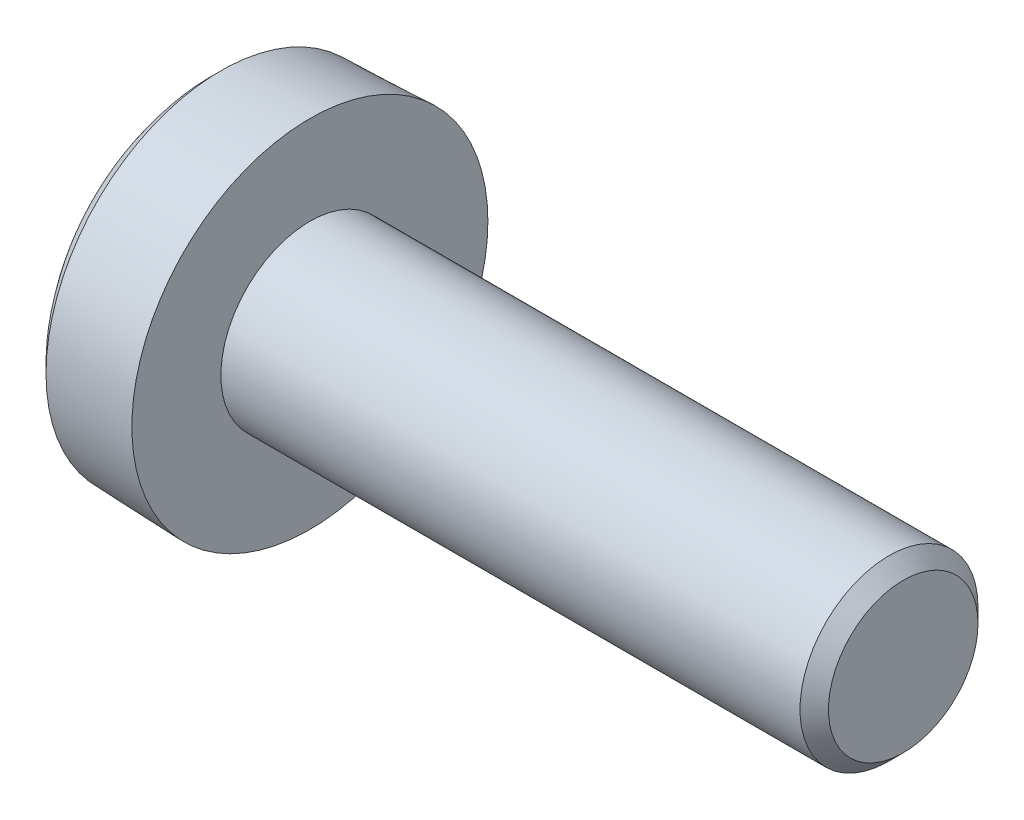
ISO-10303-21;
HEADER;
FILE_DESCRIPTION(('STEP AP214'),'2;1');
FILE_NAME('part.step','',(''),(''),'','','');
FILE_SCHEMA(('AUTOMOTIVE_DESIGN { 1 0 10303 214 1 1 1 1 }'));
ENDSEC;
DATA;
#1=APPLICATION_CONTEXT('core data for automotive mechanical design processes');
#2=APPLICATION_PROTOCOL_DEFINITION('international standard','automotive_design',2000,#1);
#3=PRODUCT_CONTEXT('',#1,'mechanical');
#4=PRODUCT('Part','Part','',(#3));
#5=PRODUCT_RELATED_PRODUCT_CATEGORY('part','',(#4));
#6=PRODUCT_DEFINITION_FORMATION('','',#4);
#7=PRODUCT_DEFINITION_CONTEXT('part definition',#1,'design');
#8=PRODUCT_DEFINITION('design','',#6,#7);
#9=PRODUCT_DEFINITION_SHAPE('','',#8);
#10=(LENGTH_UNIT() NAMED_UNIT(*) SI_UNIT(.MILLI.,.METRE.));
#11=(NAMED_UNIT(*) PLANE_ANGLE_UNIT() SI_UNIT($,.RADIAN.));
#12=(NAMED_UNIT(*) SI_UNIT($,.STERADIAN.) SOLID_ANGLE_UNIT());
#13=UNCERTAINTY_MEASURE_WITH_UNIT(LENGTH_MEASURE(1.E-05),#10,'distance_accuracy_value','');
#14=(GEOMETRIC_REPRESENTATION_CONTEXT(3) GLOBAL_UNCERTAINTY_ASSIGNED_CONTEXT((#13)) GLOBAL_UNIT_ASSIGNED_CONTEXT((#10,
#11,#12)) REPRESENTATION_CONTEXT('',''));
#15=CARTESIAN_POINT('',(0.,0.,0.));
#16=DIRECTION('',(0.,0.,1.));
#17=DIRECTION('',(1.,0.,0.));
#18=AXIS2_PLACEMENT_3D('',#15,#16,#17);
#19=CARTESIAN_POINT('',(0.0474098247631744,0.,0.));
#20=DIRECTION('',(1.,0.,0.));
#21=DIRECTION('',(0.,0.,-1.));
#22=AXIS2_PLACEMENT_3D('',#19,#20,#21);
#23=DEGENERATE_TOROIDAL_SURFACE('',#22,2.52,4.54740982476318,.T.);
#24=CARTESIAN_POINT('',(-4.4745959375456,0.,0.));
#25=DIRECTION('',(1.,0.,0.));
#26=DIRECTION('',(0.,0.,-1.));
#27=AXIS2_PLACEMENT_3D('',#24,#25,#26);
#28=CIRCLE('',#27,2.99999999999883);
#29=CARTESIAN_POINT('',(-4.47459593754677,-1.5,-2.59807621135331));
#30=VERTEX_POINT('',#29);
#31=CARTESIAN_POINT('',(-4.47459593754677,-3.,0.));
#32=VERTEX_POINT('',#31);
#33=EDGE_CURVE('E142',#30,#32,#28,.F.);
#34=ORIENTED_EDGE('',*,*,#33,.F.);
#35=CARTESIAN_POINT('',(-4.47459593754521,1.5,-2.59807621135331));
#36=VERTEX_POINT('',#35);
#37=EDGE_CURVE('E135',#36,#30,#28,.F.);
#38=ORIENTED_EDGE('',*,*,#37,.F.);
#39=CARTESIAN_POINT('',(-4.47459593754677,3.,0.));
#40=VERTEX_POINT('',#39);
#41=EDGE_CURVE('E133',#40,#36,#28,.F.);
#42=ORIENTED_EDGE('',*,*,#41,.F.);
#43=CARTESIAN_POINT('',(-4.47459593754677,1.5,2.59807621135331));
#44=VERTEX_POINT('',#43);
#45=EDGE_CURVE('E106',#44,#40,#28,.F.);
#46=ORIENTED_EDGE('',*,*,#45,.F.);
#47=CARTESIAN_POINT('',(-4.47459593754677,-1.5,2.59807621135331));
#48=VERTEX_POINT('',#47);
#49=EDGE_CURVE('E97',#48,#44,#28,.F.);
#50=ORIENTED_EDGE('',*,*,#49,.F.);
#51=EDGE_CURVE('E107',#32,#48,#28,.F.);
#52=ORIENTED_EDGE('',*,*,#51,.F.);
#53=EDGE_LOOP('',(#34,#38,#42,#46,#50,#52));
#54=FACE_BOUND('',#53,.T.);
#55=CARTESIAN_POINT('',(-3.,0.,0.));
#56=DIRECTION('',(1.,0.,0.));
#57=DIRECTION('',(0.,0.,-1.));
#58=AXIS2_PLACEMENT_3D('',#55,#56,#57);
#59=CIRCLE('',#58,5.89523769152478);
#60=CARTESIAN_POINT('',(-3.,0.,-5.89523769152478));
#61=VERTEX_POINT('',#60);
#62=EDGE_CURVE('E51',#61,#61,#59,.T.);
#63=ORIENTED_EDGE('',*,*,#62,.F.);
#64=EDGE_LOOP('',(#63));
#65=FACE_BOUND('',#64,.T.);
#66=ADVANCED_FACE('F38',(#54,#65),#23,.T.);
#67=CARTESIAN_POINT('',(0.,0.,0.));
#68=DIRECTION('',(1.,0.,0.));
#69=DIRECTION('',(0.,0.,-1.));
#70=AXIS2_PLACEMENT_3D('',#67,#68,#69);
#71=CONICAL_SURFACE('',#70,6.,0.0349065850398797);
#72=ORIENTED_EDGE('',*,*,#62,.T.);
#73=EDGE_LOOP('',(#72));
#74=FACE_BOUND('',#73,.T.);
#75=CARTESIAN_POINT('',(0.,0.,0.));
#76=DIRECTION('',(1.,0.,0.));
#77=DIRECTION('',(0.,0.,-1.));
#78=AXIS2_PLACEMENT_3D('',#75,#76,#77);
#79=CIRCLE('',#78,6.);
#80=CARTESIAN_POINT('',(0.,0.,-6.));
#81=VERTEX_POINT('',#80);
#82=EDGE_CURVE('E249',#81,#81,#79,.T.);
#83=ORIENTED_EDGE('',*,*,#82,.F.);
#84=EDGE_LOOP('',(#83));
#85=FACE_BOUND('',#84,.T.);
#86=ADVANCED_FACE('F209',(#74,#85),#71,.T.);
#87=CARTESIAN_POINT('',(0.,0.,-3.));
#88=DIRECTION('',(1.,0.,0.));
#89=DIRECTION('',(0.,0.,-1.));
#90=AXIS2_PLACEMENT_3D('',#87,#88,#89);
#91=PLANE('',#90);
#92=ORIENTED_EDGE('',*,*,#82,.T.);
#93=EDGE_LOOP('',(#92));
#94=FACE_BOUND('',#93,.T.);
#95=CARTESIAN_POINT('',(0.,0.,0.));
#96=DIRECTION('',(1.,0.,0.));
#97=DIRECTION('',(0.,0.,-1.));
#98=AXIS2_PLACEMENT_3D('',#95,#96,#97);
#99=CIRCLE('',#98,3.);
#100=CARTESIAN_POINT('',(0.,0.,-3.));
#101=VERTEX_POINT('',#100);
#102=EDGE_CURVE('E241',#101,#101,#99,.T.);
#103=ORIENTED_EDGE('',*,*,#102,.F.);
#104=EDGE_LOOP('',(#103));
#105=FACE_BOUND('',#104,.T.);
#106=ADVANCED_FACE('F213',(#94,#105),#91,.T.);
#107=CARTESIAN_POINT('',(27.4963382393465,0.,0.));
#108=DIRECTION('',(1.,0.,0.));
#109=DIRECTION('',(0.,0.,-1.));
#110=AXIS2_PLACEMENT_3D('',#107,#108,#109);
#111=CYLINDRICAL_SURFACE('',#110,3.);
#112=ORIENTED_EDGE('',*,*,#102,.T.);
#113=EDGE_LOOP('',(#112));
#114=FACE_BOUND('',#113,.T.);
#115=CARTESIAN_POINT('',(19.52,0.,0.));
#116=DIRECTION('',(1.,0.,0.));
#117=DIRECTION('',(0.,0.,-1.));
#118=AXIS2_PLACEMENT_3D('',#115,#116,#117);
#119=CIRCLE('',#118,3.);
#120=CARTESIAN_POINT('',(19.52,0.,-3.));
#121=VERTEX_POINT('',#120);
#122=EDGE_CURVE('E238',#121,#121,#119,.T.);
#123=ORIENTED_EDGE('',*,*,#122,.F.);
#124=EDGE_LOOP('',(#123));
#125=FACE_BOUND('',#124,.T.);
#126=ADVANCED_FACE('F218',(#114,#125),#111,.T.);
#127=CARTESIAN_POINT('',(20.,0.,0.));
#128=DIRECTION('',(-1.,0.,0.));
#129=DIRECTION('',(0.,0.,1.));
#130=AXIS2_PLACEMENT_3D('',#127,#128,#129);
#131=CONICAL_SURFACE('',#130,2.52,0.785398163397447);
#132=ORIENTED_EDGE('',*,*,#122,.T.);
#133=EDGE_LOOP('',(#132));
#134=FACE_BOUND('',#133,.T.);
#135=CARTESIAN_POINT('',(20.,0.,0.));
#136=DIRECTION('',(1.,0.,0.));
#137=DIRECTION('',(0.,0.,-1.));
#138=AXIS2_PLACEMENT_3D('',#135,#136,#137);
#139=CIRCLE('',#138,2.52);
#140=CARTESIAN_POINT('',(20.,0.,-2.52));
#141=VERTEX_POINT('',#140);
#142=EDGE_CURVE('E236',#141,#141,#139,.T.);
#143=ORIENTED_EDGE('',*,*,#142,.F.);
#144=EDGE_LOOP('',(#143));
#145=FACE_BOUND('',#144,.T.);
#146=ADVANCED_FACE('F226',(#134,#145),#131,.T.);
#147=CARTESIAN_POINT('',(20.,0.,0.));
#148=DIRECTION('',(1.,0.,0.));
#149=DIRECTION('',(0.,0.,-1.));
#150=AXIS2_PLACEMENT_3D('',#147,#148,#149);
#151=PLANE('',#150);
#152=ORIENTED_EDGE('',*,*,#142,.T.);
#153=EDGE_LOOP('',(#152));
#154=FACE_BOUND('',#153,.T.);
#155=ADVANCED_FACE('F164',(#154),#151,.T.);
#156=CARTESIAN_POINT('',(-3.47459593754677,0.,0.));
#157=DIRECTION('',(-1.,0.,0.));
#158=DIRECTION('',(0.,0.,1.));
#159=AXIS2_PLACEMENT_3D('',#156,#157,#158);
#160=CONICAL_SURFACE('',#159,2.,0.785398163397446);
#161=ORIENTED_EDGE('',*,*,#45,.T.);
#162=CARTESIAN_POINT('',(-4.47471141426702,1.49988452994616,2.59827621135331));
#163=CARTESIAN_POINT('',(-4.42319230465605,1.55144722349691,2.50896700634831));
#164=CARTESIAN_POINT('',(-4.37469895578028,1.60387211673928,2.41816442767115));
#165=CARTESIAN_POINT('',(-4.28590873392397,1.71077226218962,2.23300794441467));
#166=CARTESIAN_POINT('',(-4.24566126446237,1.76525768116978,2.13863643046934));
#167=CARTESIAN_POINT('',(-4.17671653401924,1.87512493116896,1.94834077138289));
#168=CARTESIAN_POINT('',(-4.14784598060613,1.93047878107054,1.85246509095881));
#169=CARTESIAN_POINT('',(-4.10336487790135,2.04240509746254,1.65860302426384));
#170=CARTESIAN_POINT('',(-4.08772112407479,2.09897414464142,1.56062256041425));
#171=CARTESIAN_POINT('',(-4.0736064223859,2.19646775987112,1.39175866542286));
#172=CARTESIAN_POINT('',(-4.07151697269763,2.23726637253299,1.32109339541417));
#173=CARTESIAN_POINT('',(-4.0750369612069,2.31879690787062,1.17987836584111));
#174=CARTESIAN_POINT('',(-4.08064909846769,2.35952880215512,1.10932865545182));
#175=CARTESIAN_POINT('',(-4.09925289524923,2.44060798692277,0.968895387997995));
#176=CARTESIAN_POINT('',(-4.11225280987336,2.48095479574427,0.899012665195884));
#177=CARTESIAN_POINT('',(-4.14491856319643,2.56095071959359,0.760455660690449));
#178=CARTESIAN_POINT('',(-4.16458389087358,2.60059988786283,0.691781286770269));
#179=CARTESIAN_POINT('',(-4.22296419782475,2.70215750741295,0.515878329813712));
#180=CARTESIAN_POINT('',(-4.26607958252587,2.76343628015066,0.409740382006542));
#181=CARTESIAN_POINT('',(-4.33886417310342,2.85354136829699,0.25367379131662));
#182=CARTESIAN_POINT('',(-4.36443731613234,2.88323502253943,0.202242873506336));
#183=CARTESIAN_POINT('',(-4.41791477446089,2.94207231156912,0.100333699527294));
#184=CARTESIAN_POINT('',(-4.44581765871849,2.97121627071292,0.0498548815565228));
#185=CARTESIAN_POINT('',(-4.47471141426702,3.00011547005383,-0.000199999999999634));
#186=B_SPLINE_CURVE_WITH_KNOTS('',3,(#162,#163,#164,#165,#166,#167,#168,#169,#170,#171,#172,
#173,#174,#175,#176,#177,#178,#179,#180,#181,#182,#183,#184,#185),.UNSPECIFIED.,.F.,.F.,(4,2,2,
2,2,2,2,2,2,2,2,4),(0.,0.346074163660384,0.694164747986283,1.03672682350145,1.37842635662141,
1.62295169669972,1.86756275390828,2.11244767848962,2.35731383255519,2.74625844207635,
2.94020339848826,3.13403008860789),.UNSPECIFIED.);
#187=EDGE_CURVE('E11',#44,#40,#186,.T.);
#188=ORIENTED_EDGE('',*,*,#187,.F.);
#189=EDGE_LOOP('',(#161,#188));
#190=FACE_BOUND('',#189,.T.);
#191=ADVANCED_FACE('F110',(#190),#160,.F.);
#192=ORIENTED_EDGE('',*,*,#49,.T.);
#193=CARTESIAN_POINT('',(-6.81917542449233,-4.67060273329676,2.59807621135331));
#194=CARTESIAN_POINT('',(-6.6991576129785,-4.53321440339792,2.59807621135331));
#195=CARTESIAN_POINT('',(-6.57979495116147,-4.39524222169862,2.59807621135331));
#196=CARTESIAN_POINT('',(-6.34284818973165,-4.11767327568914,2.59807621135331));
#197=CARTESIAN_POINT('',(-6.22526491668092,-3.97807580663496,2.59807621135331));
#198=CARTESIAN_POINT('',(-5.99003784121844,-3.69400427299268,2.59807621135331));
#199=CARTESIAN_POINT('',(-5.87244345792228,-3.54948913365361,2.59807621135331));
#200=CARTESIAN_POINT('',(-5.64060907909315,-3.25783849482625,2.59807621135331));
#201=CARTESIAN_POINT('',(-5.52636826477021,-3.11070364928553,2.59807621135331));
#202=CARTESIAN_POINT('',(-5.30238898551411,-2.81277088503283,2.59807621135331));
#203=CARTESIAN_POINT('',(-5.19265561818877,-2.66196911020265,2.59807621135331));
#204=CARTESIAN_POINT('',(-4.97979006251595,-2.35553979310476,2.59807621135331));
#205=CARTESIAN_POINT('',(-4.87666315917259,-2.19990853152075,2.59807621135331));
#206=CARTESIAN_POINT('',(-4.68110047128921,-1.88337698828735,2.59807621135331));
#207=CARTESIAN_POINT('',(-4.58860008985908,-1.72251711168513,2.59807621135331));
#208=CARTESIAN_POINT('',(-4.41909269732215,-1.3928373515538,2.59807621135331));
#209=CARTESIAN_POINT('',(-4.34205848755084,-1.22403209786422,2.59807621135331));
#210=CARTESIAN_POINT('',(-4.24384983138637,-0.962018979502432,2.59807621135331));
#211=CARTESIAN_POINT('',(-4.2137715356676,-0.872167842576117,2.59807621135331));
#212=CARTESIAN_POINT('',(-4.161376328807,-0.690201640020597,2.59807621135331));
#213=CARTESIAN_POINT('',(-4.13905819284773,-0.598086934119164,2.59807621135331));
#214=CARTESIAN_POINT('',(-4.10369375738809,-0.41274386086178,2.59807621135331));
#215=CARTESIAN_POINT('',(-4.09058223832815,-0.319528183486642,2.59807621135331));
#216=CARTESIAN_POINT('',(-4.07436270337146,-0.132224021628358,2.59807621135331));
#217=CARTESIAN_POINT('',(-4.07125316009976,-0.0381356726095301,2.59807621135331));
#218=CARTESIAN_POINT('',(-4.07529777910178,0.150123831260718,2.59807621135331));
#219=CARTESIAN_POINT('',(-4.08248563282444,0.244294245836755,2.59807621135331));
#220=CARTESIAN_POINT('',(-4.10660349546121,0.431370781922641,2.59807621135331));
#221=CARTESIAN_POINT('',(-4.12353563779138,0.524276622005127,2.59807621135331));
#222=CARTESIAN_POINT('',(-4.16611197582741,0.708796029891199,2.59807621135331));
#223=CARTESIAN_POINT('',(-4.19182315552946,0.800393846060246,2.59807621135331));
#224=CARTESIAN_POINT('',(-4.25046631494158,0.981212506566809,2.59807621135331));
#225=CARTESIAN_POINT('',(-4.28339861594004,1.07043324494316,2.59807621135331));
#226=CARTESIAN_POINT('',(-4.36147541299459,1.26216259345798,2.59807621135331));
#227=CARTESIAN_POINT('',(-4.4077503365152,1.36420636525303,2.59807621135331));
#228=CARTESIAN_POINT('',(-4.50649578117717,1.56527688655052,2.59807621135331));
#229=CARTESIAN_POINT('',(-4.55896977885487,1.66430190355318,2.59807621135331));
#230=CARTESIAN_POINT('',(-4.6687448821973,1.85987862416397,2.59807621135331));
#231=CARTESIAN_POINT('',(-4.72605547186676,1.95642496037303,2.59807621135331));
#232=CARTESIAN_POINT('',(-4.84431010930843,2.14722478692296,2.59807621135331));
#233=CARTESIAN_POINT('',(-4.90525345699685,2.24147871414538,2.59807621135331));
#234=CARTESIAN_POINT('',(-5.03032378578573,2.42859416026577,2.59807621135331));
#235=CARTESIAN_POINT('',(-5.09446647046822,2.5214451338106,2.59807621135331));
#236=CARTESIAN_POINT('',(-5.22502703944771,2.705537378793,2.59807621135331));
#237=CARTESIAN_POINT('',(-5.29144509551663,2.79677852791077,2.59807621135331));
#238=CARTESIAN_POINT('',(-5.49324614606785,3.06826872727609,2.59807621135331));
#239=CARTESIAN_POINT('',(-5.63132880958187,3.24650816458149,2.59807621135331));
#240=CARTESIAN_POINT('',(-5.9420495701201,3.63659399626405,2.59807621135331));
#241=CARTESIAN_POINT('',(-6.11580199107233,3.84754475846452,2.59807621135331));
#242=CARTESIAN_POINT('',(-6.37873828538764,4.15976665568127,2.59807621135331));
#243=CARTESIAN_POINT('',(-6.46620280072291,4.2624972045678,2.59807621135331));
#244=CARTESIAN_POINT('',(-6.64204358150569,4.46712984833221,2.59807621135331));
#245=CARTESIAN_POINT('',(-6.73041960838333,4.56903214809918,2.59807621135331));
#246=CARTESIAN_POINT('',(-6.81917542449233,4.67060273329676,2.59807621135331));
#247=B_SPLINE_CURVE_WITH_KNOTS('',3,(#193,#194,#195,#196,#197,#198,#199,#200,#201,#202,#203,
#204,#205,#206,#207,#208,#209,#210,#211,#212,#213,#214,#215,#216,#217,#218,#219,#220,#221,#222,
#223,#224,#225,#226,#227,#228,#229,#230,#231,#232,#233,#234,#235,#236,#237,#238,#239,#240,#241,
#242,#243,#244,#245,#246),.UNSPECIFIED.,.F.,.F.,(4,2,2,2,2,2,2,2,2,2,2,2,2,2,2,2,2,2,2,2,2,2,2,
2,2,2,4),(0.,0.547293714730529,1.09483430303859,1.65374182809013,2.21251173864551,
2.77189709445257,3.33172449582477,3.88794522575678,4.44317905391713,4.72715831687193,
5.0110927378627,5.29299490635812,5.57485402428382,5.8576374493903,6.14048281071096,
6.42553637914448,6.71060263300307,7.04646016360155,7.38250695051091,7.7192287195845,
8.05588580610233,8.39439948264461,8.73293877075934,9.40920550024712,10.2289939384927,
10.6337524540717,11.038407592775),.UNSPECIFIED.);
#248=EDGE_CURVE('E101',#48,#44,#247,.T.);
#249=ORIENTED_EDGE('',*,*,#248,.F.);
#250=EDGE_LOOP('',(#192,#249));
#251=FACE_BOUND('',#250,.T.);
#252=ADVANCED_FACE('F99',(#251),#160,.F.);
#253=ORIENTED_EDGE('',*,*,#51,.T.);
#254=CARTESIAN_POINT('',(-4.47471141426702,-3.00011547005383,-0.000200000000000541));
#255=CARTESIAN_POINT('',(-4.42319230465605,-2.94855277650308,0.089109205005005));
#256=CARTESIAN_POINT('',(-4.37469895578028,-2.89612788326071,0.17991178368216));
#257=CARTESIAN_POINT('',(-4.28590873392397,-2.78922773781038,0.365068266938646));
#258=CARTESIAN_POINT('',(-4.24566126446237,-2.73474231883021,0.45943978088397));
#259=CARTESIAN_POINT('',(-4.17671653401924,-2.62487506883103,0.64973543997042));
#260=CARTESIAN_POINT('',(-4.14784598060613,-2.56952121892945,0.745611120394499));
#261=CARTESIAN_POINT('',(-4.10336487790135,-2.45759490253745,0.939473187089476));
#262=CARTESIAN_POINT('',(-4.08772112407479,-2.40102585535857,1.03745365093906));
#263=CARTESIAN_POINT('',(-4.0736064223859,-2.30353224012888,1.20631754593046));
#264=CARTESIAN_POINT('',(-4.07151697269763,-2.262733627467,1.27698281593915));
#265=CARTESIAN_POINT('',(-4.0750369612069,-2.18120309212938,1.4181978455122));
#266=CARTESIAN_POINT('',(-4.08064909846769,-2.14047119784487,1.48874755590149));
#267=CARTESIAN_POINT('',(-4.09925289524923,-2.05939201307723,1.62918082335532));
#268=CARTESIAN_POINT('',(-4.11225280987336,-2.01904520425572,1.69906354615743));
#269=CARTESIAN_POINT('',(-4.14491856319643,-1.9390492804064,1.83762055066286));
#270=CARTESIAN_POINT('',(-4.16458389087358,-1.89940011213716,1.90629492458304));
#271=CARTESIAN_POINT('',(-4.22296419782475,-1.79784249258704,2.0821978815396));
#272=CARTESIAN_POINT('',(-4.26607958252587,-1.73656371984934,2.18833582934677));
#273=CARTESIAN_POINT('',(-4.33886417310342,-1.646458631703,2.34440242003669));
#274=CARTESIAN_POINT('',(-4.36443731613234,-1.61676497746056,2.39583333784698));
#275=CARTESIAN_POINT('',(-4.41791477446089,-1.55792768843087,2.49774251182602));
#276=CARTESIAN_POINT('',(-4.44581765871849,-1.52878372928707,2.54822132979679));
#277=CARTESIAN_POINT('',(-4.47471141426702,-1.49988452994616,2.59827621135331));
#278=B_SPLINE_CURVE_WITH_KNOTS('',3,(#254,#255,#256,#257,#258,#259,#260,#261,#262,#263,#264,
#265,#266,#267,#268,#269,#270,#271,#272,#273,#274,#275,#276,#277),.UNSPECIFIED.,.F.,.F.,(4,2,2,
2,2,2,2,2,2,2,2,4),(0.,0.346074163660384,0.694164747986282,1.03672682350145,1.3784263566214,
1.62295169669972,1.86756275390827,2.11244767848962,2.35731383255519,2.74625844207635,
2.94020339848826,3.13403008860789),.UNSPECIFIED.);
#279=EDGE_CURVE('E121',#32,#48,#278,.T.);
#280=ORIENTED_EDGE('',*,*,#279,.F.);
#281=EDGE_LOOP('',(#253,#280));
#282=FACE_BOUND('',#281,.T.);
#283=ADVANCED_FACE('F279',(#282),#160,.F.);
#284=ORIENTED_EDGE('',*,*,#33,.T.);
#285=CARTESIAN_POINT('',(-4.47471141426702,-1.49988452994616,-2.59827621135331));
#286=CARTESIAN_POINT('',(-4.42319230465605,-1.55144722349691,-2.50896700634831));
#287=CARTESIAN_POINT('',(-4.37469895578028,-1.60387211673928,-2.41816442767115));
#288=CARTESIAN_POINT('',(-4.28590873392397,-1.71077226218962,-2.23300794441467));
#289=CARTESIAN_POINT('',(-4.24566126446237,-1.76525768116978,-2.13863643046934));
#290=CARTESIAN_POINT('',(-4.17671653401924,-1.87512493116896,-1.94834077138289));
#291=CARTESIAN_POINT('',(-4.14784598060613,-1.93047878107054,-1.85246509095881));
#292=CARTESIAN_POINT('',(-4.10336487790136,-2.04240509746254,-1.65860302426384));
#293=CARTESIAN_POINT('',(-4.08772112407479,-2.09897414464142,-1.56062256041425));
#294=CARTESIAN_POINT('',(-4.0736064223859,-2.19646775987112,-1.39175866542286));
#295=CARTESIAN_POINT('',(-4.07151697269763,-2.23726637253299,-1.32109339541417));
#296=CARTESIAN_POINT('',(-4.0750369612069,-2.31879690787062,-1.17987836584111));
#297=CARTESIAN_POINT('',(-4.08064909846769,-2.35952880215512,-1.10932865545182));
#298=CARTESIAN_POINT('',(-4.09925289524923,-2.44060798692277,-0.968895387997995));
#299=CARTESIAN_POINT('',(-4.11225280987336,-2.48095479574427,-0.899012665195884));
#300=CARTESIAN_POINT('',(-4.14491856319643,-2.56095071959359,-0.760455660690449));
#301=CARTESIAN_POINT('',(-4.16458389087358,-2.60059988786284,-0.691781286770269));
#302=CARTESIAN_POINT('',(-4.22296419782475,-2.70215750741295,-0.515878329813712));
#303=CARTESIAN_POINT('',(-4.26607958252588,-2.76343628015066,-0.409740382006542));
#304=CARTESIAN_POINT('',(-4.33886417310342,-2.85354136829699,-0.25367379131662));
#305=CARTESIAN_POINT('',(-4.36443731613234,-2.88323502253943,-0.202242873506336));
#306=CARTESIAN_POINT('',(-4.41791477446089,-2.94207231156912,-0.100333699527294));
#307=CARTESIAN_POINT('',(-4.44581765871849,-2.97121627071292,-0.0498548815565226));
#308=CARTESIAN_POINT('',(-4.47471141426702,-3.00011547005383,0.000199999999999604));
#309=B_SPLINE_CURVE_WITH_KNOTS('',3,(#285,#286,#287,#288,#289,#290,#291,#292,#293,#294,#295,
#296,#297,#298,#299,#300,#301,#302,#303,#304,#305,#306,#307,#308),.UNSPECIFIED.,.F.,.F.,(4,2,2,
2,2,2,2,2,2,2,2,4),(0.,0.346074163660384,0.694164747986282,1.03672682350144,1.3784263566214,
1.62295169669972,1.86756275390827,2.11244767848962,2.35731383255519,2.74625844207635,
2.94020339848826,3.13403008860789),.UNSPECIFIED.);
#310=EDGE_CURVE('E145',#30,#32,#309,.T.);
#311=ORIENTED_EDGE('',*,*,#310,.F.);
#312=EDGE_LOOP('',(#284,#311));
#313=FACE_BOUND('',#312,.T.);
#314=ADVANCED_FACE('F282',(#313),#160,.F.);
#315=ORIENTED_EDGE('',*,*,#37,.T.);
#316=CARTESIAN_POINT('',(-6.81917542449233,4.67060273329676,-2.59807621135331));
#317=CARTESIAN_POINT('',(-6.6991576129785,4.53321440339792,-2.59807621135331));
#318=CARTESIAN_POINT('',(-6.57979495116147,4.39524222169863,-2.59807621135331));
#319=CARTESIAN_POINT('',(-6.34284818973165,4.11767327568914,-2.59807621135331));
#320=CARTESIAN_POINT('',(-6.22526491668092,3.97807580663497,-2.59807621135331));
#321=CARTESIAN_POINT('',(-5.99003784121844,3.69400427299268,-2.59807621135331));
#322=CARTESIAN_POINT('',(-5.87244345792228,3.54948913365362,-2.59807621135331));
#323=CARTESIAN_POINT('',(-5.64060907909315,3.25783849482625,-2.59807621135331));
#324=CARTESIAN_POINT('',(-5.52636826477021,3.11070364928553,-2.59807621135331));
#325=CARTESIAN_POINT('',(-5.30238898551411,2.81277088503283,-2.59807621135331));
#326=CARTESIAN_POINT('',(-5.19265561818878,2.66196911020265,-2.59807621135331));
#327=CARTESIAN_POINT('',(-4.97979006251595,2.35553979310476,-2.59807621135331));
#328=CARTESIAN_POINT('',(-4.87666315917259,2.19990853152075,-2.59807621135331));
#329=CARTESIAN_POINT('',(-4.68110047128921,1.88337698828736,-2.59807621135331));
#330=CARTESIAN_POINT('',(-4.58860008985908,1.72251711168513,-2.59807621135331));
#331=CARTESIAN_POINT('',(-4.41909269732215,1.39283735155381,-2.59807621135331));
#332=CARTESIAN_POINT('',(-4.34205848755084,1.22403209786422,-2.59807621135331));
#333=CARTESIAN_POINT('',(-4.24384983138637,0.962018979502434,-2.59807621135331));
#334=CARTESIAN_POINT('',(-4.2137715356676,0.872167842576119,-2.59807621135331));
#335=CARTESIAN_POINT('',(-4.161376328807,0.690201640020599,-2.59807621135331));
#336=CARTESIAN_POINT('',(-4.13905819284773,0.598086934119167,-2.59807621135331));
#337=CARTESIAN_POINT('',(-4.10369375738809,0.412743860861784,-2.59807621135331));
#338=CARTESIAN_POINT('',(-4.09058223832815,0.319528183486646,-2.59807621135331));
#339=CARTESIAN_POINT('',(-4.07436270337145,0.132224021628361,-2.59807621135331));
#340=CARTESIAN_POINT('',(-4.07125316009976,0.0381356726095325,-2.59807621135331));
#341=CARTESIAN_POINT('',(-4.07529777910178,-0.150123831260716,-2.59807621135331));
#342=CARTESIAN_POINT('',(-4.08248563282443,-0.244294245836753,-2.59807621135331));
#343=CARTESIAN_POINT('',(-4.1066034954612,-0.431370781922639,-2.59807621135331));
#344=CARTESIAN_POINT('',(-4.12353563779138,-0.524276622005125,-2.59807621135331));
#345=CARTESIAN_POINT('',(-4.1661119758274,-0.708796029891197,-2.59807621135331));
#346=CARTESIAN_POINT('',(-4.19182315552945,-0.800393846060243,-2.59807621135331));
#347=CARTESIAN_POINT('',(-4.25046631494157,-0.981212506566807,-2.59807621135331));
#348=CARTESIAN_POINT('',(-4.28339861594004,-1.07043324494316,-2.59807621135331));
#349=CARTESIAN_POINT('',(-4.36147541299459,-1.26216259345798,-2.59807621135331));
#350=CARTESIAN_POINT('',(-4.40775033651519,-1.36420636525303,-2.59807621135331));
#351=CARTESIAN_POINT('',(-4.50649578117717,-1.56527688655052,-2.59807621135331));
#352=CARTESIAN_POINT('',(-4.55896977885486,-1.66430190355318,-2.59807621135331));
#353=CARTESIAN_POINT('',(-4.66874488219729,-1.85987862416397,-2.59807621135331));
#354=CARTESIAN_POINT('',(-4.72605547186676,-1.95642496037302,-2.59807621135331));
#355=CARTESIAN_POINT('',(-4.84431010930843,-2.14722478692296,-2.59807621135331));
#356=CARTESIAN_POINT('',(-4.90525345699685,-2.24147871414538,-2.59807621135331));
#357=CARTESIAN_POINT('',(-5.03032378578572,-2.42859416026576,-2.59807621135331));
#358=CARTESIAN_POINT('',(-5.09446647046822,-2.5214451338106,-2.59807621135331));
#359=CARTESIAN_POINT('',(-5.2250270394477,-2.705537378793,-2.59807621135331));
#360=CARTESIAN_POINT('',(-5.29144509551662,-2.79677852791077,-2.59807621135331));
#361=CARTESIAN_POINT('',(-5.49324614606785,-3.06826872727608,-2.59807621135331));
#362=CARTESIAN_POINT('',(-5.63132880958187,-3.24650816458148,-2.59807621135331));
#363=CARTESIAN_POINT('',(-5.94204957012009,-3.63659399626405,-2.59807621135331));
#364=CARTESIAN_POINT('',(-6.11580199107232,-3.84754475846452,-2.59807621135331));
#365=CARTESIAN_POINT('',(-6.37873828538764,-4.15976665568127,-2.59807621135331));
#366=CARTESIAN_POINT('',(-6.46620280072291,-4.2624972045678,-2.59807621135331));
#367=CARTESIAN_POINT('',(-6.64204358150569,-4.46712984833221,-2.59807621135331));
#368=CARTESIAN_POINT('',(-6.73041960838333,-4.56903214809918,-2.59807621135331));
#369=CARTESIAN_POINT('',(-6.81917542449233,-4.67060273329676,-2.59807621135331));
#370=B_SPLINE_CURVE_WITH_KNOTS('',3,(#316,#317,#318,#319,#320,#321,#322,#323,#324,#325,#326,
#327,#328,#329,#330,#331,#332,#333,#334,#335,#336,#337,#338,#339,#340,#341,#342,#343,#344,#345,
#346,#347,#348,#349,#350,#351,#352,#353,#354,#355,#356,#357,#358,#359,#360,#361,#362,#363,#364,
#365,#366,#367,#368,#369),.UNSPECIFIED.,.F.,.F.,(4,2,2,2,2,2,2,2,2,2,2,2,2,2,2,2,2,2,2,2,2,2,2,
2,2,2,4),(0.,0.54729371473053,1.09483430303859,1.65374182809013,2.21251173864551,
2.77189709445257,3.33172449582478,3.88794522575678,4.44317905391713,4.72715831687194,
5.0110927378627,5.29299490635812,5.57485402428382,5.8576374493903,6.14048281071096,
6.42553637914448,6.71060263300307,7.04646016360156,7.38250695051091,7.7192287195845,
8.05588580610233,8.3943994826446,8.73293877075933,9.40920550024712,10.2289939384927,
10.6337524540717,11.038407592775),.UNSPECIFIED.);
#371=EDGE_CURVE('E143',#36,#30,#370,.T.);
#372=ORIENTED_EDGE('',*,*,#371,.F.);
#373=EDGE_LOOP('',(#315,#372));
#374=FACE_BOUND('',#373,.T.);
#375=ADVANCED_FACE('F165',(#374),#160,.F.);
#376=ORIENTED_EDGE('',*,*,#41,.T.);
#377=CARTESIAN_POINT('',(-4.47471141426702,3.00011547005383,0.000200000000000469));
#378=CARTESIAN_POINT('',(-4.42319230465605,2.94855277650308,-0.0891092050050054));
#379=CARTESIAN_POINT('',(-4.37469895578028,2.89612788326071,-0.17991178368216));
#380=CARTESIAN_POINT('',(-4.28590873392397,2.78922773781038,-0.365068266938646));
#381=CARTESIAN_POINT('',(-4.24566126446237,2.73474231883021,-0.45943978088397));
#382=CARTESIAN_POINT('',(-4.17671653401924,2.62487506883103,-0.64973543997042));
#383=CARTESIAN_POINT('',(-4.14784598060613,2.56952121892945,-0.745611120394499));
#384=CARTESIAN_POINT('',(-4.10336487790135,2.45759490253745,-0.939473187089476));
#385=CARTESIAN_POINT('',(-4.08772112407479,2.40102585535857,-1.03745365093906));
#386=CARTESIAN_POINT('',(-4.0736064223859,2.30353224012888,-1.20631754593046));
#387=CARTESIAN_POINT('',(-4.07151697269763,2.262733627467,-1.27698281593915));
#388=CARTESIAN_POINT('',(-4.0750369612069,2.18120309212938,-1.4181978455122));
#389=CARTESIAN_POINT('',(-4.08064909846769,2.14047119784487,-1.48874755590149));
#390=CARTESIAN_POINT('',(-4.09925289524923,2.05939201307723,-1.62918082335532));
#391=CARTESIAN_POINT('',(-4.11225280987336,2.01904520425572,-1.69906354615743));
#392=CARTESIAN_POINT('',(-4.14491856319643,1.9390492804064,-1.83762055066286));
#393=CARTESIAN_POINT('',(-4.16458389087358,1.89940011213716,-1.90629492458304));
#394=CARTESIAN_POINT('',(-4.22296419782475,1.79784249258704,-2.0821978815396));
#395=CARTESIAN_POINT('',(-4.26607958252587,1.73656371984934,-2.18833582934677));
#396=CARTESIAN_POINT('',(-4.33886417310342,1.646458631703,-2.34440242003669));
#397=CARTESIAN_POINT('',(-4.36443731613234,1.61676497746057,-2.39583333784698));
#398=CARTESIAN_POINT('',(-4.41791477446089,1.55792768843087,-2.49774251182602));
#399=CARTESIAN_POINT('',(-4.44581765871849,1.52878372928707,-2.54822132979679));
#400=CARTESIAN_POINT('',(-4.47471141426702,1.49988452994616,-2.59827621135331));
#401=B_SPLINE_CURVE_WITH_KNOTS('',3,(#377,#378,#379,#380,#381,#382,#383,#384,#385,#386,#387,
#388,#389,#390,#391,#392,#393,#394,#395,#396,#397,#398,#399,#400),.UNSPECIFIED.,.F.,.F.,(4,2,2,
2,2,2,2,2,2,2,2,4),(0.,0.346074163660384,0.694164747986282,1.03672682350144,1.3784263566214,
1.62295169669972,1.86756275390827,2.11244767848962,2.35731383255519,2.74625844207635,
2.94020339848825,3.13403008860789),.UNSPECIFIED.);
#402=EDGE_CURVE('E57',#40,#36,#401,.T.);
#403=ORIENTED_EDGE('',*,*,#402,.F.);
#404=EDGE_LOOP('',(#376,#403));
#405=FACE_BOUND('',#404,.T.);
#406=ADVANCED_FACE('F206',(#405),#160,.F.);
#407=CARTESIAN_POINT('',(-1.,0.,0.));
#408=DIRECTION('',(1.,0.,0.));
#409=DIRECTION('',(0.,0.,-1.));
#410=AXIS2_PLACEMENT_3D('',#407,#408,#409);
#411=PLANE('',#410);
#412=DIRECTION('',(0.,0.5,0.866025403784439));
#413=VECTOR('',#412,1.);
#414=CARTESIAN_POINT('',(-1.,1.5,-2.59807621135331));
#415=LINE('',#414,#413);
#416=CARTESIAN_POINT('',(-1.,1.5,-2.59807621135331));
#417=VERTEX_POINT('',#416);
#418=CARTESIAN_POINT('',(-1.,3.,0.));
#419=VERTEX_POINT('',#418);
#420=EDGE_CURVE('E134',#417,#419,#415,.T.);
#421=ORIENTED_EDGE('',*,*,#420,.F.);
#422=DIRECTION('',(0.,1.,0.));
#423=VECTOR('',#422,1.);
#424=CARTESIAN_POINT('',(-1.,-1.5,-2.59807621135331));
#425=LINE('',#424,#423);
#426=CARTESIAN_POINT('',(-1.,-1.5,-2.59807621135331));
#427=VERTEX_POINT('',#426);
#428=EDGE_CURVE('E257',#427,#417,#425,.T.);
#429=ORIENTED_EDGE('',*,*,#428,.F.);
#430=DIRECTION('',(0.,0.5,-0.866025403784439));
#431=VECTOR('',#430,1.);
#432=CARTESIAN_POINT('',(-1.,-3.,0.));
#433=LINE('',#432,#431);
#434=CARTESIAN_POINT('',(-1.,-3.,0.));
#435=VERTEX_POINT('',#434);
#436=EDGE_CURVE('E264',#435,#427,#433,.T.);
#437=ORIENTED_EDGE('',*,*,#436,.F.);
#438=DIRECTION('',(0.,-0.5,-0.866025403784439));
#439=VECTOR('',#438,1.);
#440=CARTESIAN_POINT('',(-1.,-1.5,2.59807621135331));
#441=LINE('',#440,#439);
#442=CARTESIAN_POINT('',(-1.,-1.5,2.59807621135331));
#443=VERTEX_POINT('',#442);
#444=EDGE_CURVE('E267',#443,#435,#441,.T.);
#445=ORIENTED_EDGE('',*,*,#444,.F.);
#446=DIRECTION('',(0.,-1.,0.));
#447=VECTOR('',#446,1.);
#448=CARTESIAN_POINT('',(-1.,1.5,2.59807621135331));
#449=LINE('',#448,#447);
#450=CARTESIAN_POINT('',(-1.,1.5,2.59807621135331));
#451=VERTEX_POINT('',#450);
#452=EDGE_CURVE('E270',#451,#443,#449,.T.);
#453=ORIENTED_EDGE('',*,*,#452,.F.);
#454=DIRECTION('',(0.,-0.5,0.866025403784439));
#455=VECTOR('',#454,1.);
#456=CARTESIAN_POINT('',(-1.,3.,0.));
#457=LINE('',#456,#455);
#458=EDGE_CURVE('E126',#419,#451,#457,.T.);
#459=ORIENTED_EDGE('',*,*,#458,.F.);
#460=EDGE_LOOP('',(#421,#429,#437,#445,#453,#459));
#461=FACE_BOUND('',#460,.T.);
#462=ADVANCED_FACE('F166',(#461),#411,.F.);
#463=CARTESIAN_POINT('',(-4.5,3.,0.));
#464=DIRECTION('',(0.,0.866025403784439,0.5));
#465=DIRECTION('',(0.,-0.5,0.866025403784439));
#466=AXIS2_PLACEMENT_3D('',#463,#464,#465);
#467=PLANE('',#466);
#468=DIRECTION('',(1.,0.,0.));
#469=VECTOR('',#468,1.);
#470=CARTESIAN_POINT('',(-4.5,1.5,2.59807621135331));
#471=LINE('',#470,#469);
#472=EDGE_CURVE('E118',#44,#451,#471,.T.);
#473=ORIENTED_EDGE('',*,*,#472,.F.);
#474=ORIENTED_EDGE('',*,*,#187,.T.);
#475=DIRECTION('',(1.,0.,0.));
#476=VECTOR('',#475,1.);
#477=CARTESIAN_POINT('',(-4.5,3.,0.));
#478=LINE('',#477,#476);
#479=EDGE_CURVE('E127',#40,#419,#478,.T.);
#480=ORIENTED_EDGE('',*,*,#479,.T.);
#481=ORIENTED_EDGE('',*,*,#458,.T.);
#482=EDGE_LOOP('',(#473,#474,#480,#481));
#483=FACE_BOUND('',#482,.T.);
#484=ADVANCED_FACE('F124',(#483),#467,.F.);
#485=CARTESIAN_POINT('',(-4.5,1.5,2.59807621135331));
#486=DIRECTION('',(0.,0.,1.));
#487=DIRECTION('',(0.,-1.,0.));
#488=AXIS2_PLACEMENT_3D('',#485,#486,#487);
#489=PLANE('',#488);
#490=DIRECTION('',(1.,0.,0.));
#491=VECTOR('',#490,1.);
#492=CARTESIAN_POINT('',(-4.5,-1.5,2.59807621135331));
#493=LINE('',#492,#491);
#494=EDGE_CURVE('E120',#48,#443,#493,.T.);
#495=ORIENTED_EDGE('',*,*,#494,.F.);
#496=ORIENTED_EDGE('',*,*,#248,.T.);
#497=ORIENTED_EDGE('',*,*,#472,.T.);
#498=ORIENTED_EDGE('',*,*,#452,.T.);
#499=EDGE_LOOP('',(#495,#496,#497,#498));
#500=FACE_BOUND('',#499,.T.);
#501=ADVANCED_FACE('F116',(#500),#489,.F.);
#502=CARTESIAN_POINT('',(-4.5,-1.5,2.59807621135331));
#503=DIRECTION('',(0.,-0.866025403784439,0.5));
#504=DIRECTION('',(0.,-0.5,-0.866025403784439));
#505=AXIS2_PLACEMENT_3D('',#502,#503,#504);
#506=PLANE('',#505);
#507=DIRECTION('',(1.,0.,0.));
#508=VECTOR('',#507,1.);
#509=CARTESIAN_POINT('',(-4.5,-3.,0.));
#510=LINE('',#509,#508);
#511=EDGE_CURVE('E260',#32,#435,#510,.T.);
#512=ORIENTED_EDGE('',*,*,#511,.F.);
#513=ORIENTED_EDGE('',*,*,#279,.T.);
#514=ORIENTED_EDGE('',*,*,#494,.T.);
#515=ORIENTED_EDGE('',*,*,#444,.T.);
#516=EDGE_LOOP('',(#512,#513,#514,#515));
#517=FACE_BOUND('',#516,.T.);
#518=ADVANCED_FACE('F193',(#517),#506,.F.);
#519=CARTESIAN_POINT('',(-4.5,-3.,0.));
#520=DIRECTION('',(0.,-0.866025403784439,-0.5));
#521=DIRECTION('',(0.,0.5,-0.866025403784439));
#522=AXIS2_PLACEMENT_3D('',#519,#520,#521);
#523=PLANE('',#522);
#524=DIRECTION('',(1.,0.,0.));
#525=VECTOR('',#524,1.);
#526=CARTESIAN_POINT('',(-4.5,-1.5,-2.59807621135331));
#527=LINE('',#526,#525);
#528=EDGE_CURVE('E243',#30,#427,#527,.T.);
#529=ORIENTED_EDGE('',*,*,#528,.F.);
#530=ORIENTED_EDGE('',*,*,#310,.T.);
#531=ORIENTED_EDGE('',*,*,#511,.T.);
#532=ORIENTED_EDGE('',*,*,#436,.T.);
#533=EDGE_LOOP('',(#529,#530,#531,#532));
#534=FACE_BOUND('',#533,.T.);
#535=ADVANCED_FACE('F189',(#534),#523,.F.);
#536=CARTESIAN_POINT('',(-4.5,-1.5,-2.59807621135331));
#537=DIRECTION('',(0.,0.,-1.));
#538=DIRECTION('',(0.,1.,0.));
#539=AXIS2_PLACEMENT_3D('',#536,#537,#538);
#540=PLANE('',#539);
#541=DIRECTION('',(1.,0.,0.));
#542=VECTOR('',#541,1.);
#543=CARTESIAN_POINT('',(-4.5,1.5,-2.59807621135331));
#544=LINE('',#543,#542);
#545=EDGE_CURVE('E65',#36,#417,#544,.T.);
#546=ORIENTED_EDGE('',*,*,#545,.F.);
#547=ORIENTED_EDGE('',*,*,#371,.T.);
#548=ORIENTED_EDGE('',*,*,#528,.T.);
#549=ORIENTED_EDGE('',*,*,#428,.T.);
#550=EDGE_LOOP('',(#546,#547,#548,#549));
#551=FACE_BOUND('',#550,.T.);
#552=ADVANCED_FACE('F192',(#551),#540,.F.);
#553=CARTESIAN_POINT('',(-4.5,1.5,-2.59807621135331));
#554=DIRECTION('',(0.,0.866025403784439,-0.5));
#555=DIRECTION('',(0.,0.5,0.866025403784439));
#556=AXIS2_PLACEMENT_3D('',#553,#554,#555);
#557=PLANE('',#556);
#558=ORIENTED_EDGE('',*,*,#479,.F.);
#559=ORIENTED_EDGE('',*,*,#402,.T.);
#560=ORIENTED_EDGE('',*,*,#545,.T.);
#561=ORIENTED_EDGE('',*,*,#420,.T.);
#562=EDGE_LOOP('',(#558,#559,#560,#561));
#563=FACE_BOUND('',#562,.T.);
#564=ADVANCED_FACE('F158',(#563),#557,.F.);
#565=CLOSED_SHELL('',(#66,#86,#106,#126,#146,#155,#191,#252,#283,#314,#375,#406,#462,#484,#501,
#518,#535,#552,#564));
#566=MANIFOLD_SOLID_BREP('B2',#565);
#567=ADVANCED_BREP_SHAPE_REPRESENTATION('',(#18,#566),#14);
#568=SHAPE_DEFINITION_REPRESENTATION(#9,#567);
ENDSEC;
END-ISO-10303-21;
